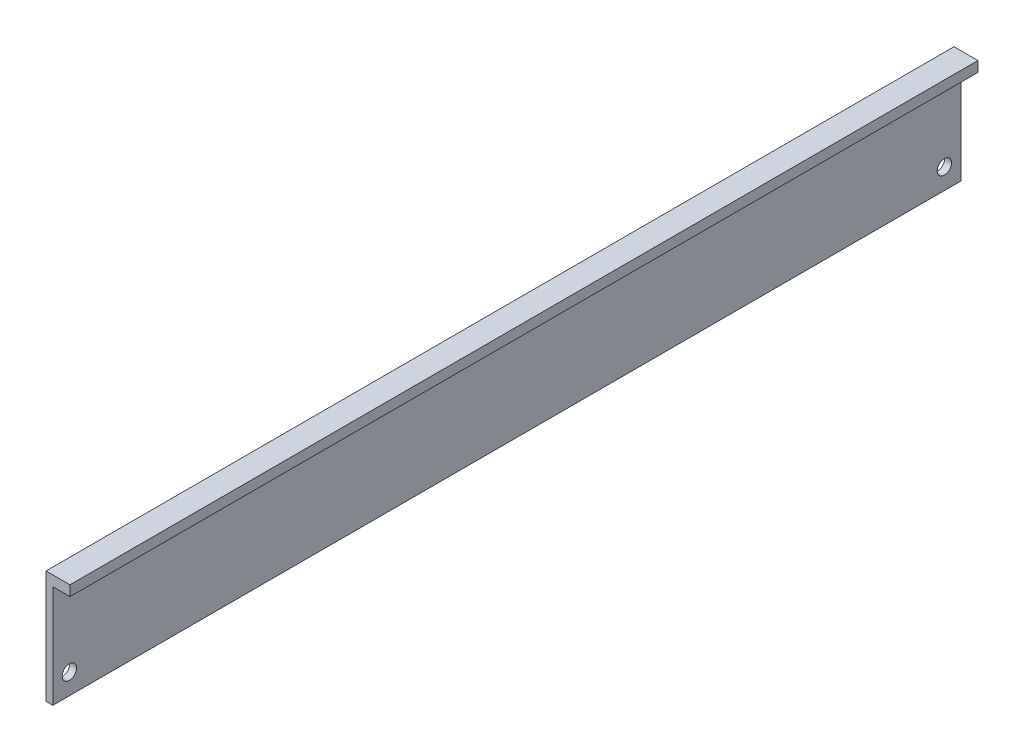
from build123d import *

# Parameters (mm, degrees)
SKETCH_1_W                  = 132
SKETCH_1_H                  = 33
EXTRUDE_1_DEPTH             = 7
SKETCH_2_W                  = 5
SKETCH_2_H                  = 30
CUT_EXTRUDE_1_DEPTH         = 4488.962068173
HOLE_WIZARD_4_2_4_2_1_D     = 4.2
HOLE_WIZARD_4_2_4_2_1_DEPTH = 7
EXTRUDE_2_DEPTH             = 133.35
SKETCH_6_R                  = 2.1
CUT_EXTRUDE_2_DEPTH         = 1701.516936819


with BuildPart() as part:
    # Sketch 1 → Extrude 1 (new body)
    with BuildSketch(Plane(origin=(4153.366453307, 0, 0), x_dir=(0, 0, -1), z_dir=(1, 0, 0))):
        with Locations((66, 1678.76594666)):
            Rectangle(SKETCH_1_W, SKETCH_1_H)
    extrude(amount=-EXTRUDE_1_DEPTH)

    # Sketch 2 → Cut-Extrude 1 (cut, through all)
    with BuildSketch(Plane(origin=(0, 0, -132), x_dir=(-1, 0, 0), z_dir=(0, 0, -1))):
        with Locations((-4150.866453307, 1677.26594666)):
            Rectangle(SKETCH_2_W, SKETCH_2_H)
    extrude(amount=-CUT_EXTRUDE_1_DEPTH, mode=Mode.SUBTRACT)

    # Hole Wizard 4.2 _4.2_ _1
    with Locations(Plane.ZY.offset(-4146.366453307)):
        with Locations((-127.175, 1668.26594666)):
            Hole(HOLE_WIZARD_4_2_4_2_1_D / 2, depth=HOLE_WIZARD_4_2_4_2_1_DEPTH)

    # Sketch 5 → Extrude 2 (add)
    with BuildSketch(Plane.XY):
        Polygon((4148.366453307, 1662.26594666), (4148.366453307, 1692.26594666), (4153.366453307, 1692.26594666), (4153.366453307, 1695.26594666), (4146.366453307, 1695.26594666), (4146.366453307, 1662.26594666), align=None)
    extrude(amount=EXTRUDE_2_DEPTH)

    # Sketch 6 → Cut-Extrude 2 (cut, through all)
    with BuildSketch(Plane.ZY.offset(-4146.366453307)):
        with Locations((128.52, 1668.26594666)):
            Circle(SKETCH_6_R)
        with Locations((-127.175, 1668.26594666)):
            Circle(SKETCH_6_R)
    extrude(amount=-CUT_EXTRUDE_2_DEPTH, mode=Mode.SUBTRACT)


solid = part.part
